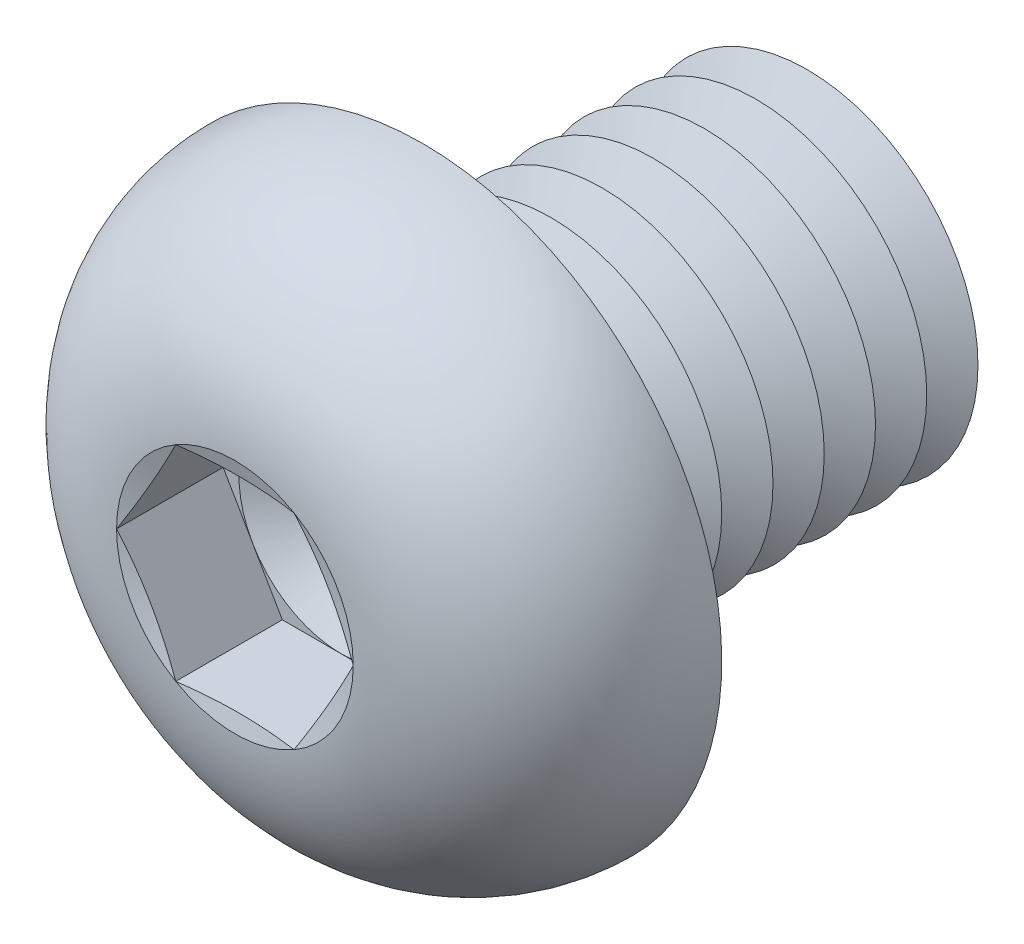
from build123d import *

# Parameters (mm, degrees)
FILLET1_R          = 0.75
LPATTERN1_COUNT    = 8
LPATTERN1_PITCH    = 1.5
CUT_EXTRUDE1_DEPTH = 3.12


with BuildPart() as part:
    # Sketch1 → Revolve1 (revolve)
    with BuildSketch(Plane(origin=(0, 0, 0), x_dir=(0, 0, -1), z_dir=(1, 0, 0))):
        with BuildLine():
            Line((0, 5), (0, 8.75))
            ThreePointArc((0, 8.75), (-3.814142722, 7.21429474), (-5.5, 3.4641))
            Line((-5.5, 3.4641), (-5.035898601, 1.73205))
            Line((-5.035898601, 1.73205), (-5.5, 1.73205))
            Line((-5.5, 1.73205), (-5.5, 0))
            Line((-5.5, 0), (12, 0))
            Line((12, 0), (12, 5))
            Line((12, 5), (0, 5))
        make_face()
    revolve(axis=Axis((0, 0, -12), (0, 0, 1)))

    # Fillet1
    fillet1_edges = [part.edges().sort_by_distance(p)[0] for p in [
        (0, -5, 0),
    ]]
    fillet(fillet1_edges, radius=FILLET1_R)

    # Sketch2 → Cut-Revolve1 (revolve, cut)
    with BuildSketch(Plane(origin=(0, 0, 0), x_dir=(0, 0, -1), z_dir=(1, 0, 0))):
        Polygon((11.25, 5), (12.75, 5), (12, 3.700961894), align=None)
    cut_revolve1 = revolve(axis=Axis((0, 0, -12), (0, 0, -1)), mode=Mode.SUBTRACT)

    # LPattern1: Cut-Revolve1 ×8
    with Locations(*[(0, 0, i * LPATTERN1_PITCH) for i in range(1, LPATTERN1_COUNT)]):
        add(cut_revolve1, mode=Mode.SUBTRACT)

    # Sketch3 → Cut-Extrude1 (cut)
    with BuildSketch(Plane.XY.offset(5.5)):
        Polygon((1.73205, 2.999998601), (-1.73205, 2.999998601), (-3.4641, 0), (-1.73205, -2.999998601), (1.73205, -2.999998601), (3.4641, 0), align=None)
    extrude(amount=-CUT_EXTRUDE1_DEPTH, mode=Mode.SUBTRACT)

    # Cut-Extrude2 cone 1 section (on through the dimple's axis) → Cut-Extrude2 (revolve, cut)
    with BuildSketch(Plane(origin=(0, 0, 2.38), x_dir=(0, -1, 0), z_dir=(1, 0, 0))):
        Polygon((0, 0), (2.999998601, 0), (0, 1.73205), align=None)
    revolve(axis=Axis((0, 0, 2.38), (0, 0, -1)), mode=Mode.SUBTRACT)


solid = part.part
